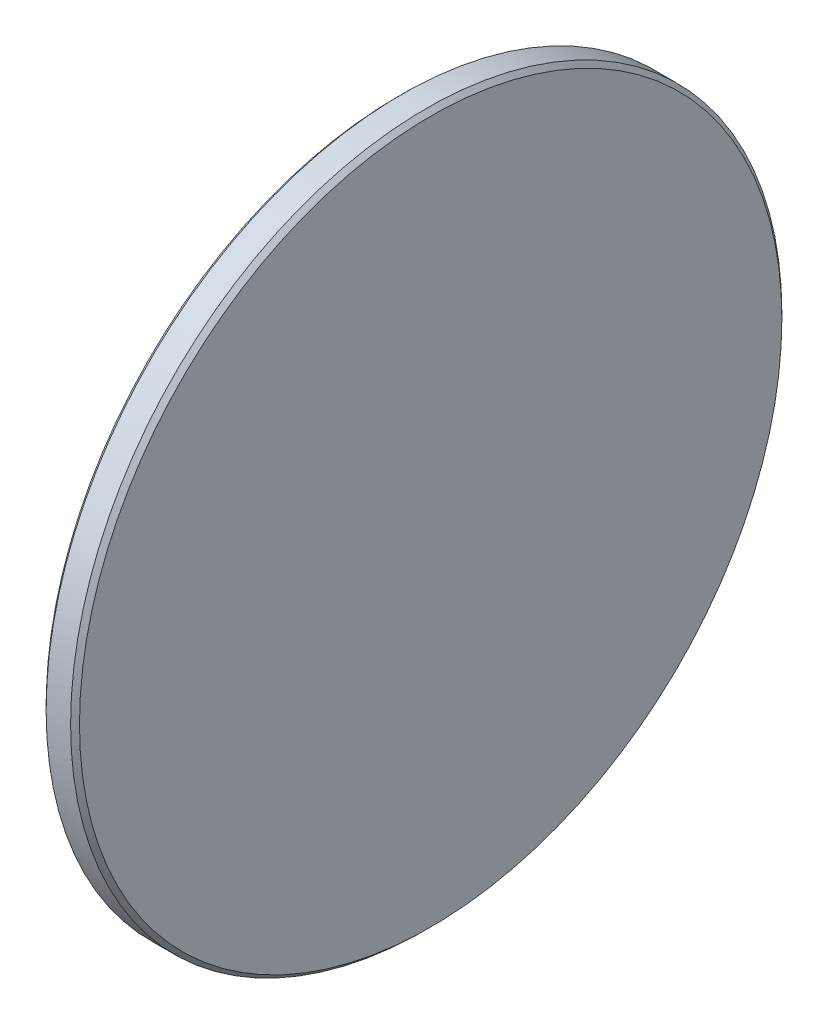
from build123d import *

# Parameters (mm, degrees)
SKETCH1_R           = 101.6
BOSS_EXTRUDE1_DEPTH = 9.525
CHAMFER1_SIZE       = 1.27


with BuildPart() as part:
    # Sketch1 → Boss-Extrude1 (new body)
    with BuildSketch(Plane(origin=(0, 0, 0), x_dir=(0, 0, -1), z_dir=(1, 0, 0))):
        with Locations(Location((0, 0, 0), (0, 0, 180))):
            Circle(SKETCH1_R)
    extrude(amount=BOSS_EXTRUDE1_DEPTH)

    # Chamfer1
    chamfer1_edges = [part.edges().sort_by_distance(p)[0] for p in [
        (0, 0, -101.6),
        (9.525, 0, -101.6),
    ]]
    chamfer(chamfer1_edges, length=CHAMFER1_SIZE)


solid = part.part
